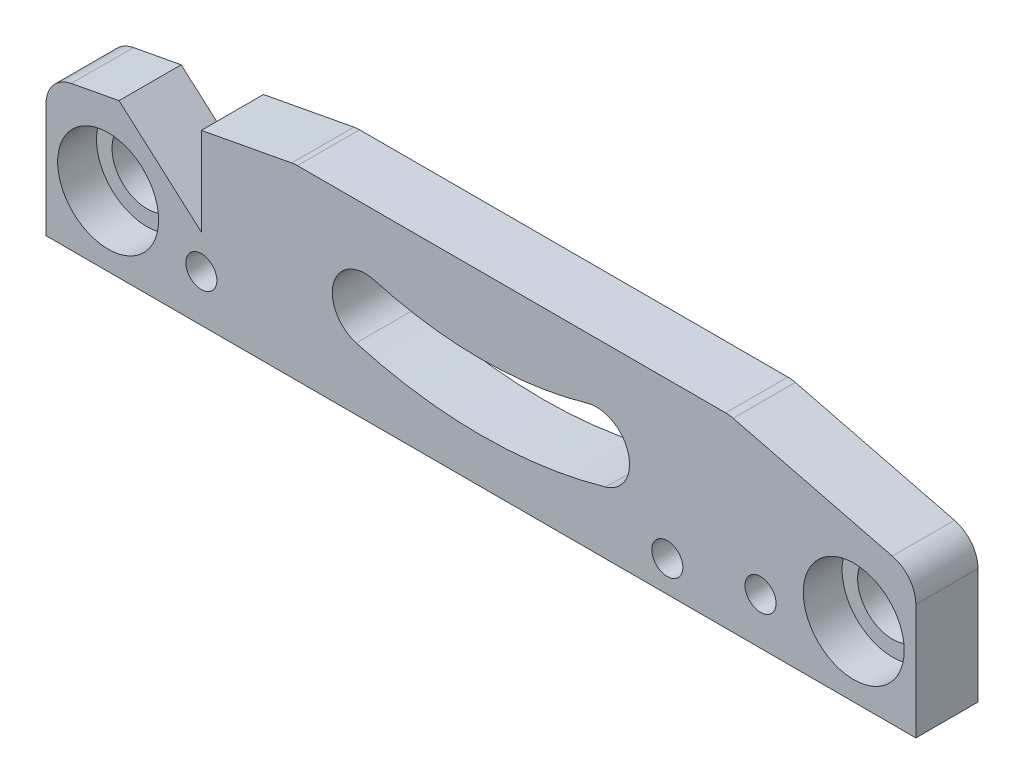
ISO-10303-21;
HEADER;
FILE_DESCRIPTION(('STEP AP214'),'2;1');
FILE_NAME('part.step','',(''),(''),'','','');
FILE_SCHEMA(('AUTOMOTIVE_DESIGN { 1 0 10303 214 1 1 1 1 }'));
ENDSEC;
DATA;
#1=APPLICATION_CONTEXT('core data for automotive mechanical design processes');
#2=APPLICATION_PROTOCOL_DEFINITION('international standard','automotive_design',2000,#1);
#3=PRODUCT_CONTEXT('',#1,'mechanical');
#4=PRODUCT('Part','Part','',(#3));
#5=PRODUCT_RELATED_PRODUCT_CATEGORY('part','',(#4));
#6=PRODUCT_DEFINITION_FORMATION('','',#4);
#7=PRODUCT_DEFINITION_CONTEXT('part definition',#1,'design');
#8=PRODUCT_DEFINITION('design','',#6,#7);
#9=PRODUCT_DEFINITION_SHAPE('','',#8);
#10=(LENGTH_UNIT() NAMED_UNIT(*) SI_UNIT(.MILLI.,.METRE.));
#11=(NAMED_UNIT(*) PLANE_ANGLE_UNIT() SI_UNIT($,.RADIAN.));
#12=(NAMED_UNIT(*) SI_UNIT($,.STERADIAN.) SOLID_ANGLE_UNIT());
#13=UNCERTAINTY_MEASURE_WITH_UNIT(LENGTH_MEASURE(1.E-05),#10,'distance_accuracy_value','');
#14=(GEOMETRIC_REPRESENTATION_CONTEXT(3) GLOBAL_UNCERTAINTY_ASSIGNED_CONTEXT((#13)) GLOBAL_UNIT_ASSIGNED_CONTEXT((#10,
#11,#12)) REPRESENTATION_CONTEXT('',''));
#15=CARTESIAN_POINT('',(0.,0.,0.));
#16=DIRECTION('',(0.,0.,1.));
#17=DIRECTION('',(1.,0.,0.));
#18=AXIS2_PLACEMENT_3D('',#15,#16,#17);
#19=CARTESIAN_POINT('',(-44.45,19.05,6.35));
#20=DIRECTION('',(0.,0.,1.));
#21=DIRECTION('',(1.,0.,0.));
#22=AXIS2_PLACEMENT_3D('',#19,#20,#21);
#23=PLANE('',#22);
#24=CARTESIAN_POINT('',(-28.575,4.7625,6.35));
#25=DIRECTION('',(0.,0.,1.));
#26=DIRECTION('',(1.,0.,0.));
#27=AXIS2_PLACEMENT_3D('',#24,#25,#26);
#28=CIRCLE('',#27,1.5875);
#29=CARTESIAN_POINT('',(-26.9875,4.7625,6.35));
#30=VERTEX_POINT('',#29);
#31=EDGE_CURVE('E549',#30,#30,#28,.T.);
#32=ORIENTED_EDGE('',*,*,#31,.F.);
#33=EDGE_LOOP('',(#32));
#34=FACE_BOUND('',#33,.T.);
#35=CARTESIAN_POINT('',(19.05,3.17500000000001,6.34999999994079));
#36=DIRECTION('',(0.,0.,1.));
#37=DIRECTION('',(1.,0.,0.));
#38=AXIS2_PLACEMENT_3D('',#35,#36,#37);
#39=CIRCLE('',#38,1.5875);
#40=CARTESIAN_POINT('',(20.6375,3.17500000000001,6.34999999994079));
#41=VERTEX_POINT('',#40);
#42=EDGE_CURVE('E550',#41,#41,#39,.T.);
#43=ORIENTED_EDGE('',*,*,#42,.F.);
#44=EDGE_LOOP('',(#43));
#45=FACE_BOUND('',#44,.T.);
#46=CARTESIAN_POINT('',(28.575,4.7625,6.35));
#47=DIRECTION('',(0.,0.,1.));
#48=DIRECTION('',(1.,0.,0.));
#49=AXIS2_PLACEMENT_3D('',#46,#47,#48);
#50=CIRCLE('',#49,1.5875);
#51=CARTESIAN_POINT('',(30.1625,4.7625,6.35));
#52=VERTEX_POINT('',#51);
#53=EDGE_CURVE('E558',#52,#52,#50,.T.);
#54=ORIENTED_EDGE('',*,*,#53,.F.);
#55=EDGE_LOOP('',(#54));
#56=FACE_BOUND('',#55,.T.);
#57=CARTESIAN_POINT('',(-38.1,7.14375,6.35));
#58=DIRECTION('',(0.,0.,1.));
#59=DIRECTION('',(1.,0.,0.));
#60=AXIS2_PLACEMENT_3D('',#57,#58,#59);
#61=CIRCLE('',#60,5.15937499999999);
#62=CARTESIAN_POINT('',(-32.940625,7.14375,6.35));
#63=VERTEX_POINT('',#62);
#64=EDGE_CURVE('E574',#63,#63,#61,.T.);
#65=ORIENTED_EDGE('',*,*,#64,.F.);
#66=EDGE_LOOP('',(#65));
#67=FACE_BOUND('',#66,.T.);
#68=CARTESIAN_POINT('',(0.,50.8,6.35));
#69=DIRECTION('',(0.,0.,-1.));
#70=DIRECTION('',(-1.,0.,0.));
#71=AXIS2_PLACEMENT_3D('',#68,#69,#70);
#72=CIRCLE('',#71,46.2359375);
#73=CARTESIAN_POINT('',(12.7443515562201,6.35516430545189,6.35));
#74=VERTEX_POINT('',#73);
#75=CARTESIAN_POINT('',(-12.74435155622,6.35516430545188,6.35));
#76=VERTEX_POINT('',#75);
#77=EDGE_CURVE('E163',#74,#76,#72,.T.);
#78=ORIENTED_EDGE('',*,*,#77,.T.);
#79=CARTESIAN_POINT('',(-11.8145061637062,9.59792055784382,6.35));
#80=DIRECTION('',(0.,0.,-1.));
#81=DIRECTION('',(-1.,0.,0.));
#82=AXIS2_PLACEMENT_3D('',#79,#80,#81);
#83=CIRCLE('',#82,3.3734375);
#84=CARTESIAN_POINT('',(-10.8846607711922,12.8406768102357,6.35));
#85=VERTEX_POINT('',#84);
#86=EDGE_CURVE('E183',#76,#85,#83,.T.);
#87=ORIENTED_EDGE('',*,*,#86,.T.);
#88=CARTESIAN_POINT('',(0.,50.8,6.35));
#89=DIRECTION('',(0.,0.,1.));
#90=DIRECTION('',(1.,0.,0.));
#91=AXIS2_PLACEMENT_3D('',#88,#89,#90);
#92=CIRCLE('',#91,39.4890625);
#93=CARTESIAN_POINT('',(10.8846607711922,12.8406768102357,6.35));
#94=VERTEX_POINT('',#93);
#95=EDGE_CURVE('E169',#85,#94,#92,.T.);
#96=ORIENTED_EDGE('',*,*,#95,.T.);
#97=CARTESIAN_POINT('',(11.8145061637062,9.59792055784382,6.35));
#98=DIRECTION('',(0.,0.,-1.));
#99=DIRECTION('',(-1.,0.,0.));
#100=AXIS2_PLACEMENT_3D('',#97,#98,#99);
#101=CIRCLE('',#100,3.3734375);
#102=EDGE_CURVE('E187',#94,#74,#101,.T.);
#103=ORIENTED_EDGE('',*,*,#102,.T.);
#104=EDGE_LOOP('',(#78,#87,#96,#103));
#105=FACE_BOUND('',#104,.T.);
#106=DIRECTION('',(0.,1.,0.));
#107=VECTOR('',#106,1.);
#108=CARTESIAN_POINT('',(44.45,0.,6.35));
#109=LINE('',#108,#107);
#110=CARTESIAN_POINT('',(44.45,0.,6.35));
#111=VERTEX_POINT('',#110);
#112=CARTESIAN_POINT('',(44.45,11.808534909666,6.35));
#113=VERTEX_POINT('',#112);
#114=EDGE_CURVE('E230',#111,#113,#109,.T.);
#115=ORIENTED_EDGE('',*,*,#114,.T.);
#116=CARTESIAN_POINT('',(41.275,11.808534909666,6.35));
#117=DIRECTION('',(0.,0.,1.));
#118=DIRECTION('',(1.,0.,0.));
#119=AXIS2_PLACEMENT_3D('',#116,#117,#118);
#120=CIRCLE('',#119,3.175);
#121=CARTESIAN_POINT('',(42.0450506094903,14.8887373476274,6.35));
#122=VERTEX_POINT('',#121);
#123=EDGE_CURVE('E262',#113,#122,#120,.T.);
#124=ORIENTED_EDGE('',*,*,#123,.T.);
#125=DIRECTION('',(-0.970142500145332,0.242535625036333,0.));
#126=VECTOR('',#125,1.);
#127=CARTESIAN_POINT('',(44.45,14.2875,6.35));
#128=LINE('',#127,#126);
#129=CARTESIAN_POINT('',(25.7791902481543,18.9552024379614,6.35));
#130=VERTEX_POINT('',#129);
#131=EDGE_CURVE('E220',#122,#130,#128,.T.);
#132=ORIENTED_EDGE('',*,*,#131,.T.);
#133=CARTESIAN_POINT('',(25.0091396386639,15.875,6.35));
#134=DIRECTION('',(0.,0.,1.));
#135=DIRECTION('',(1.,0.,0.));
#136=AXIS2_PLACEMENT_3D('',#133,#134,#135);
#137=CIRCLE('',#136,3.175);
#138=CARTESIAN_POINT('',(25.0091396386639,19.05,6.35));
#139=VERTEX_POINT('',#138);
#140=EDGE_CURVE('E256',#130,#139,#137,.T.);
#141=ORIENTED_EDGE('',*,*,#140,.T.);
#142=DIRECTION('',(1.,0.,0.));
#143=VECTOR('',#142,1.);
#144=CARTESIAN_POINT('',(-44.45,19.05,6.35));
#145=LINE('',#144,#143);
#146=CARTESIAN_POINT('',(-18.7549148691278,19.05,6.35));
#147=VERTEX_POINT('',#146);
#148=EDGE_CURVE('E227',#147,#139,#145,.T.);
#149=ORIENTED_EDGE('',*,*,#148,.F.);
#150=CARTESIAN_POINT('',(-18.7549148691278,15.875,6.35));
#151=DIRECTION('',(0.,0.,1.));
#152=DIRECTION('',(1.,0.,0.));
#153=AXIS2_PLACEMENT_3D('',#150,#151,#152);
#154=CIRCLE('',#153,3.175);
#155=CARTESIAN_POINT('',(-19.3400309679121,18.9956191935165,6.35));
#156=VERTEX_POINT('',#155);
#157=EDGE_CURVE('E258',#147,#156,#154,.T.);
#158=ORIENTED_EDGE('',*,*,#157,.T.);
#159=DIRECTION('',(0.982872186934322,0.184288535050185,0.));
#160=VECTOR('',#159,1.);
#161=CARTESIAN_POINT('',(-44.45,14.2875,6.35));
#162=LINE('',#161,#160);
#163=CARTESIAN_POINT('',(-28.575,17.2640625,6.35));
#164=VERTEX_POINT('',#163);
#165=EDGE_CURVE('E214',#164,#156,#162,.T.);
#166=ORIENTED_EDGE('',*,*,#165,.F.);
#167=DIRECTION('',(0.,1.,0.));
#168=VECTOR('',#167,1.);
#169=CARTESIAN_POINT('',(-28.575,8.26226105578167,6.35));
#170=LINE('',#169,#168);
#171=CARTESIAN_POINT('',(-28.575,8.26226105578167,6.35));
#172=VERTEX_POINT('',#171);
#173=EDGE_CURVE('E170',#172,#164,#170,.T.);
#174=ORIENTED_EDGE('',*,*,#173,.F.);
#175=DIRECTION('',(0.749616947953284,-0.661871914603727,0.));
#176=VECTOR('',#175,1.);
#177=CARTESIAN_POINT('',(-36.9843867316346,15.6873024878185,6.35));
#178=LINE('',#177,#176);
#179=CARTESIAN_POINT('',(-36.9843867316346,15.6873024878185,6.35));
#180=VERTEX_POINT('',#179);
#181=EDGE_CURVE('E200',#180,#172,#178,.T.);
#182=ORIENTED_EDGE('',*,*,#181,.F.);
#183=CARTESIAN_POINT('',(-41.8601160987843,14.7731032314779,6.35));
#184=VERTEX_POINT('',#183);
#185=EDGE_CURVE('E215',#184,#180,#162,.T.);
#186=ORIENTED_EDGE('',*,*,#185,.F.);
#187=CARTESIAN_POINT('',(-41.275,11.6524840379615,6.35));
#188=DIRECTION('',(0.,0.,1.));
#189=DIRECTION('',(1.,0.,0.));
#190=AXIS2_PLACEMENT_3D('',#187,#188,#189);
#191=CIRCLE('',#190,3.175);
#192=CARTESIAN_POINT('',(-44.45,11.6524840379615,6.35));
#193=VERTEX_POINT('',#192);
#194=EDGE_CURVE('E260',#184,#193,#191,.T.);
#195=ORIENTED_EDGE('',*,*,#194,.T.);
#196=DIRECTION('',(0.,1.,0.));
#197=VECTOR('',#196,1.);
#198=CARTESIAN_POINT('',(-44.45,0.,6.35));
#199=LINE('',#198,#197);
#200=CARTESIAN_POINT('',(-44.45,0.,6.35));
#201=VERTEX_POINT('',#200);
#202=EDGE_CURVE('E237',#201,#193,#199,.T.);
#203=ORIENTED_EDGE('',*,*,#202,.F.);
#204=DIRECTION('',(-1.,0.,0.));
#205=VECTOR('',#204,1.);
#206=CARTESIAN_POINT('',(44.45,0.,6.35));
#207=LINE('',#206,#205);
#208=EDGE_CURVE('E234',#111,#201,#207,.T.);
#209=ORIENTED_EDGE('',*,*,#208,.F.);
#210=EDGE_LOOP('',(#115,#124,#132,#141,#149,#158,#166,#174,#182,#186,#195,#203,#209));
#211=FACE_BOUND('',#210,.T.);
#212=CARTESIAN_POINT('',(38.1,7.14375,6.35));
#213=DIRECTION('',(0.,0.,1.));
#214=DIRECTION('',(1.,0.,0.));
#215=AXIS2_PLACEMENT_3D('',#212,#213,#214);
#216=CIRCLE('',#215,5.15937499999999);
#217=CARTESIAN_POINT('',(43.259375,7.14375,6.35));
#218=VERTEX_POINT('',#217);
#219=EDGE_CURVE('E185',#218,#218,#216,.T.);
#220=ORIENTED_EDGE('',*,*,#219,.F.);
#221=EDGE_LOOP('',(#220));
#222=FACE_BOUND('',#221,.T.);
#223=ADVANCED_FACE('F32',(#34,#45,#56,#67,#105,#211,#222),#23,.T.);
#224=CARTESIAN_POINT('',(-44.45,19.05,0.));
#225=DIRECTION('',(0.,0.,1.));
#226=DIRECTION('',(1.,0.,0.));
#227=AXIS2_PLACEMENT_3D('',#224,#225,#226);
#228=PLANE('',#227);
#229=CARTESIAN_POINT('',(-28.575,4.7625,0.));
#230=DIRECTION('',(0.,0.,1.));
#231=DIRECTION('',(1.,0.,0.));
#232=AXIS2_PLACEMENT_3D('',#229,#230,#231);
#233=CIRCLE('',#232,1.5875);
#234=CARTESIAN_POINT('',(-26.9875,4.7625,0.));
#235=VERTEX_POINT('',#234);
#236=EDGE_CURVE('E547',#235,#235,#233,.T.);
#237=ORIENTED_EDGE('',*,*,#236,.T.);
#238=EDGE_LOOP('',(#237));
#239=FACE_BOUND('',#238,.T.);
#240=CARTESIAN_POINT('',(19.05,3.17500000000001,0.));
#241=DIRECTION('',(0.,0.,1.));
#242=DIRECTION('',(1.,0.,0.));
#243=AXIS2_PLACEMENT_3D('',#240,#241,#242);
#244=CIRCLE('',#243,1.5875);
#245=CARTESIAN_POINT('',(20.6375,3.17500000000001,0.));
#246=VERTEX_POINT('',#245);
#247=EDGE_CURVE('E553',#246,#246,#244,.T.);
#248=ORIENTED_EDGE('',*,*,#247,.T.);
#249=EDGE_LOOP('',(#248));
#250=FACE_BOUND('',#249,.T.);
#251=CARTESIAN_POINT('',(28.575,4.7625,0.));
#252=DIRECTION('',(0.,0.,1.));
#253=DIRECTION('',(1.,0.,0.));
#254=AXIS2_PLACEMENT_3D('',#251,#252,#253);
#255=CIRCLE('',#254,1.5875);
#256=CARTESIAN_POINT('',(30.1625,4.7625,0.));
#257=VERTEX_POINT('',#256);
#258=EDGE_CURVE('E560',#257,#257,#255,.T.);
#259=ORIENTED_EDGE('',*,*,#258,.T.);
#260=EDGE_LOOP('',(#259));
#261=FACE_BOUND('',#260,.T.);
#262=CARTESIAN_POINT('',(-38.1,7.14375,0.));
#263=DIRECTION('',(0.,0.,1.));
#264=DIRECTION('',(1.,0.,0.));
#265=AXIS2_PLACEMENT_3D('',#262,#263,#264);
#266=CIRCLE('',#265,3.57187500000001);
#267=CARTESIAN_POINT('',(-34.528125,7.14375,0.));
#268=VERTEX_POINT('',#267);
#269=EDGE_CURVE('E563',#268,#268,#266,.T.);
#270=ORIENTED_EDGE('',*,*,#269,.T.);
#271=EDGE_LOOP('',(#270));
#272=FACE_BOUND('',#271,.T.);
#273=CARTESIAN_POINT('',(-11.8145061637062,9.59792055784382,0.));
#274=DIRECTION('',(0.,0.,-1.));
#275=DIRECTION('',(-1.,0.,0.));
#276=AXIS2_PLACEMENT_3D('',#273,#274,#275);
#277=CIRCLE('',#276,3.3734375);
#278=CARTESIAN_POINT('',(-12.74435155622,6.35516430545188,0.));
#279=VERTEX_POINT('',#278);
#280=CARTESIAN_POINT('',(-10.8846607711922,12.8406768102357,0.));
#281=VERTEX_POINT('',#280);
#282=EDGE_CURVE('E152',#279,#281,#277,.T.);
#283=ORIENTED_EDGE('',*,*,#282,.F.);
#284=CARTESIAN_POINT('',(0.,50.8,0.));
#285=DIRECTION('',(0.,0.,-1.));
#286=DIRECTION('',(-1.,0.,0.));
#287=AXIS2_PLACEMENT_3D('',#284,#285,#286);
#288=CIRCLE('',#287,46.2359375);
#289=CARTESIAN_POINT('',(12.7443515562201,6.35516430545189,0.));
#290=VERTEX_POINT('',#289);
#291=EDGE_CURVE('E178',#290,#279,#288,.T.);
#292=ORIENTED_EDGE('',*,*,#291,.F.);
#293=CARTESIAN_POINT('',(11.8145061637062,9.59792055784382,0.));
#294=DIRECTION('',(0.,0.,-1.));
#295=DIRECTION('',(-1.,0.,0.));
#296=AXIS2_PLACEMENT_3D('',#293,#294,#295);
#297=CIRCLE('',#296,3.3734375);
#298=CARTESIAN_POINT('',(10.8846607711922,12.8406768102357,0.));
#299=VERTEX_POINT('',#298);
#300=EDGE_CURVE('E176',#299,#290,#297,.T.);
#301=ORIENTED_EDGE('',*,*,#300,.F.);
#302=CARTESIAN_POINT('',(0.,50.8,0.));
#303=DIRECTION('',(0.,0.,1.));
#304=DIRECTION('',(1.,0.,0.));
#305=AXIS2_PLACEMENT_3D('',#302,#303,#304);
#306=CIRCLE('',#305,39.4890625);
#307=EDGE_CURVE('E162',#281,#299,#306,.T.);
#308=ORIENTED_EDGE('',*,*,#307,.F.);
#309=EDGE_LOOP('',(#283,#292,#301,#308));
#310=FACE_BOUND('',#309,.T.);
#311=DIRECTION('',(-0.970142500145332,0.242535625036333,0.));
#312=VECTOR('',#311,1.);
#313=CARTESIAN_POINT('',(44.45,14.2875,0.));
#314=LINE('',#313,#312);
#315=CARTESIAN_POINT('',(42.0450506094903,14.8887373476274,0.));
#316=VERTEX_POINT('',#315);
#317=CARTESIAN_POINT('',(25.7791902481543,18.9552024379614,0.));
#318=VERTEX_POINT('',#317);
#319=EDGE_CURVE('E221',#316,#318,#314,.T.);
#320=ORIENTED_EDGE('',*,*,#319,.F.);
#321=CARTESIAN_POINT('',(41.275,11.808534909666,0.));
#322=DIRECTION('',(0.,0.,1.));
#323=DIRECTION('',(1.,0.,0.));
#324=AXIS2_PLACEMENT_3D('',#321,#322,#323);
#325=CIRCLE('',#324,3.175);
#326=CARTESIAN_POINT('',(44.45,11.808534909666,0.));
#327=VERTEX_POINT('',#326);
#328=EDGE_CURVE('E274',#316,#327,#325,.F.);
#329=ORIENTED_EDGE('',*,*,#328,.T.);
#330=DIRECTION('',(0.,1.,0.));
#331=VECTOR('',#330,1.);
#332=CARTESIAN_POINT('',(44.45,0.,0.));
#333=LINE('',#332,#331);
#334=CARTESIAN_POINT('',(44.45,0.,0.));
#335=VERTEX_POINT('',#334);
#336=EDGE_CURVE('E243',#335,#327,#333,.T.);
#337=ORIENTED_EDGE('',*,*,#336,.F.);
#338=DIRECTION('',(-1.,0.,0.));
#339=VECTOR('',#338,1.);
#340=CARTESIAN_POINT('',(44.45,0.,0.));
#341=LINE('',#340,#339);
#342=CARTESIAN_POINT('',(-44.45,0.,0.));
#343=VERTEX_POINT('',#342);
#344=EDGE_CURVE('E246',#335,#343,#341,.T.);
#345=ORIENTED_EDGE('',*,*,#344,.T.);
#346=DIRECTION('',(0.,1.,0.));
#347=VECTOR('',#346,1.);
#348=CARTESIAN_POINT('',(-44.45,0.,0.));
#349=LINE('',#348,#347);
#350=CARTESIAN_POINT('',(-44.45,11.6524840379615,0.));
#351=VERTEX_POINT('',#350);
#352=EDGE_CURVE('E231',#343,#351,#349,.T.);
#353=ORIENTED_EDGE('',*,*,#352,.T.);
#354=CARTESIAN_POINT('',(-41.275,11.6524840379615,0.));
#355=DIRECTION('',(0.,0.,1.));
#356=DIRECTION('',(1.,0.,0.));
#357=AXIS2_PLACEMENT_3D('',#354,#355,#356);
#358=CIRCLE('',#357,3.175);
#359=CARTESIAN_POINT('',(-41.8601160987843,14.7731032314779,0.));
#360=VERTEX_POINT('',#359);
#361=EDGE_CURVE('E47',#351,#360,#358,.F.);
#362=ORIENTED_EDGE('',*,*,#361,.T.);
#363=DIRECTION('',(-0.982872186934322,-0.184288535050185,0.));
#364=VECTOR('',#363,1.);
#365=CARTESIAN_POINT('',(-43.587358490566,14.4492452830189,0.));
#366=LINE('',#365,#364);
#367=CARTESIAN_POINT('',(-36.9843867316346,15.6873024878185,0.));
#368=VERTEX_POINT('',#367);
#369=EDGE_CURVE('E217',#368,#360,#366,.T.);
#370=ORIENTED_EDGE('',*,*,#369,.F.);
#371=DIRECTION('',(0.749616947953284,-0.661871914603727,0.));
#372=VECTOR('',#371,1.);
#373=CARTESIAN_POINT('',(-36.9843867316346,15.6873024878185,0.));
#374=LINE('',#373,#372);
#375=CARTESIAN_POINT('',(-28.575,8.26226105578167,0.));
#376=VERTEX_POINT('',#375);
#377=EDGE_CURVE('E199',#368,#376,#374,.T.);
#378=ORIENTED_EDGE('',*,*,#377,.T.);
#379=DIRECTION('',(0.,1.,0.));
#380=VECTOR('',#379,1.);
#381=CARTESIAN_POINT('',(-28.575,8.26226105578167,0.));
#382=LINE('',#381,#380);
#383=CARTESIAN_POINT('',(-28.575,17.2640625,0.));
#384=VERTEX_POINT('',#383);
#385=EDGE_CURVE('E196',#376,#384,#382,.T.);
#386=ORIENTED_EDGE('',*,*,#385,.T.);
#387=CARTESIAN_POINT('',(-19.3400309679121,18.9956191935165,0.));
#388=VERTEX_POINT('',#387);
#389=EDGE_CURVE('E218',#388,#384,#366,.T.);
#390=ORIENTED_EDGE('',*,*,#389,.F.);
#391=CARTESIAN_POINT('',(-18.7549148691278,15.875,0.));
#392=DIRECTION('',(0.,0.,1.));
#393=DIRECTION('',(1.,0.,0.));
#394=AXIS2_PLACEMENT_3D('',#391,#392,#393);
#395=CIRCLE('',#394,3.175);
#396=CARTESIAN_POINT('',(-18.7549148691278,19.05,0.));
#397=VERTEX_POINT('',#396);
#398=EDGE_CURVE('E271',#388,#397,#395,.F.);
#399=ORIENTED_EDGE('',*,*,#398,.T.);
#400=DIRECTION('',(1.,0.,0.));
#401=VECTOR('',#400,1.);
#402=CARTESIAN_POINT('',(-44.45,19.05,0.));
#403=LINE('',#402,#401);
#404=CARTESIAN_POINT('',(25.0091396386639,19.05,0.));
#405=VERTEX_POINT('',#404);
#406=EDGE_CURVE('E224',#397,#405,#403,.T.);
#407=ORIENTED_EDGE('',*,*,#406,.T.);
#408=CARTESIAN_POINT('',(25.0091396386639,15.875,0.));
#409=DIRECTION('',(0.,0.,1.));
#410=DIRECTION('',(1.,0.,0.));
#411=AXIS2_PLACEMENT_3D('',#408,#409,#410);
#412=CIRCLE('',#411,3.175);
#413=EDGE_CURVE('E269',#405,#318,#412,.F.);
#414=ORIENTED_EDGE('',*,*,#413,.T.);
#415=EDGE_LOOP('',(#320,#329,#337,#345,#353,#362,#370,#378,#386,#390,#399,#407,#414));
#416=FACE_BOUND('',#415,.T.);
#417=CARTESIAN_POINT('',(38.1,7.14375,0.));
#418=DIRECTION('',(0.,0.,1.));
#419=DIRECTION('',(1.,0.,0.));
#420=AXIS2_PLACEMENT_3D('',#417,#418,#419);
#421=CIRCLE('',#420,3.57187500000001);
#422=CARTESIAN_POINT('',(41.671875,7.14375,0.));
#423=VERTEX_POINT('',#422);
#424=EDGE_CURVE('E577',#423,#423,#421,.T.);
#425=ORIENTED_EDGE('',*,*,#424,.T.);
#426=EDGE_LOOP('',(#425));
#427=FACE_BOUND('',#426,.T.);
#428=ADVANCED_FACE('F174',(#239,#250,#261,#272,#310,#416,#427),#228,.F.);
#429=CARTESIAN_POINT('',(-44.45,14.2875,6.35));
#430=DIRECTION('',(-0.184288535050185,0.982872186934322,0.));
#431=DIRECTION('',(-0.982872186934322,-0.184288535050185,0.));
#432=AXIS2_PLACEMENT_3D('',#429,#430,#431);
#433=PLANE('',#432);
#434=ORIENTED_EDGE('',*,*,#165,.T.);
#435=DIRECTION('',(0.,0.,-1.));
#436=VECTOR('',#435,1.);
#437=CARTESIAN_POINT('',(-19.3400309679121,18.9956191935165,6.35));
#438=LINE('',#437,#436);
#439=EDGE_CURVE('E280',#156,#388,#438,.T.);
#440=ORIENTED_EDGE('',*,*,#439,.T.);
#441=ORIENTED_EDGE('',*,*,#389,.T.);
#442=DIRECTION('',(0.,0.,1.));
#443=VECTOR('',#442,1.);
#444=CARTESIAN_POINT('',(-28.575,17.2640625,0.));
#445=LINE('',#444,#443);
#446=EDGE_CURVE('E211',#384,#164,#445,.T.);
#447=ORIENTED_EDGE('',*,*,#446,.T.);
#448=EDGE_LOOP('',(#434,#440,#441,#447));
#449=FACE_BOUND('',#448,.T.);
#450=ADVANCED_FACE('F333',(#449),#433,.T.);
#451=CARTESIAN_POINT('',(-44.45,19.05,6.35));
#452=DIRECTION('',(0.,1.,0.));
#453=DIRECTION('',(-1.,0.,0.));
#454=AXIS2_PLACEMENT_3D('',#451,#452,#453);
#455=PLANE('',#454);
#456=ORIENTED_EDGE('',*,*,#406,.F.);
#457=DIRECTION('',(0.,0.,-1.));
#458=VECTOR('',#457,1.);
#459=CARTESIAN_POINT('',(-18.7549148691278,19.05,6.35));
#460=LINE('',#459,#458);
#461=EDGE_CURVE('E11',#397,#147,#460,.F.);
#462=ORIENTED_EDGE('',*,*,#461,.T.);
#463=ORIENTED_EDGE('',*,*,#148,.T.);
#464=DIRECTION('',(0.,0.,1.));
#465=VECTOR('',#464,1.);
#466=CARTESIAN_POINT('',(25.0091396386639,19.05,6.35));
#467=LINE('',#466,#465);
#468=EDGE_CURVE('E40',#139,#405,#467,.F.);
#469=ORIENTED_EDGE('',*,*,#468,.T.);
#470=EDGE_LOOP('',(#456,#462,#463,#469));
#471=FACE_BOUND('',#470,.T.);
#472=ADVANCED_FACE('F285',(#471),#455,.T.);
#473=CARTESIAN_POINT('',(-44.45,0.,6.35));
#474=DIRECTION('',(-1.,0.,0.));
#475=DIRECTION('',(0.,-1.,0.));
#476=AXIS2_PLACEMENT_3D('',#473,#474,#475);
#477=PLANE('',#476);
#478=ORIENTED_EDGE('',*,*,#202,.T.);
#479=DIRECTION('',(0.,0.,-1.));
#480=VECTOR('',#479,1.);
#481=CARTESIAN_POINT('',(-44.45,11.6524840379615,6.35));
#482=LINE('',#481,#480);
#483=EDGE_CURVE('E276',#193,#351,#482,.T.);
#484=ORIENTED_EDGE('',*,*,#483,.T.);
#485=ORIENTED_EDGE('',*,*,#352,.F.);
#486=DIRECTION('',(0.,0.,-1.));
#487=VECTOR('',#486,1.);
#488=CARTESIAN_POINT('',(-44.45,0.,6.35));
#489=LINE('',#488,#487);
#490=EDGE_CURVE('E250',#201,#343,#489,.T.);
#491=ORIENTED_EDGE('',*,*,#490,.F.);
#492=EDGE_LOOP('',(#478,#484,#485,#491));
#493=FACE_BOUND('',#492,.T.);
#494=ADVANCED_FACE('F315',(#493),#477,.T.);
#495=CARTESIAN_POINT('',(44.45,0.,6.35));
#496=DIRECTION('',(-1.,0.,0.));
#497=DIRECTION('',(0.,-1.,0.));
#498=AXIS2_PLACEMENT_3D('',#495,#496,#497);
#499=PLANE('',#498);
#500=ORIENTED_EDGE('',*,*,#336,.T.);
#501=DIRECTION('',(0.,0.,1.));
#502=VECTOR('',#501,1.);
#503=CARTESIAN_POINT('',(44.45,11.808534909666,6.35));
#504=LINE('',#503,#502);
#505=EDGE_CURVE('E252',#327,#113,#504,.T.);
#506=ORIENTED_EDGE('',*,*,#505,.T.);
#507=ORIENTED_EDGE('',*,*,#114,.F.);
#508=DIRECTION('',(0.,0.,-1.));
#509=VECTOR('',#508,1.);
#510=CARTESIAN_POINT('',(44.45,0.,6.35));
#511=LINE('',#510,#509);
#512=EDGE_CURVE('E240',#111,#335,#511,.T.);
#513=ORIENTED_EDGE('',*,*,#512,.T.);
#514=EDGE_LOOP('',(#500,#506,#507,#513));
#515=FACE_BOUND('',#514,.T.);
#516=ADVANCED_FACE('F307',(#515),#499,.F.);
#517=CARTESIAN_POINT('',(44.45,0.,6.35));
#518=DIRECTION('',(0.,-1.,0.));
#519=DIRECTION('',(1.,0.,0.));
#520=AXIS2_PLACEMENT_3D('',#517,#518,#519);
#521=PLANE('',#520);
#522=ORIENTED_EDGE('',*,*,#344,.F.);
#523=ORIENTED_EDGE('',*,*,#512,.F.);
#524=ORIENTED_EDGE('',*,*,#208,.T.);
#525=ORIENTED_EDGE('',*,*,#490,.T.);
#526=EDGE_LOOP('',(#522,#523,#524,#525));
#527=FACE_BOUND('',#526,.T.);
#528=ADVANCED_FACE('F312',(#527),#521,.T.);
#529=CARTESIAN_POINT('',(44.45,14.2875,0.));
#530=DIRECTION('',(0.242535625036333,0.970142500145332,0.));
#531=DIRECTION('',(-0.970142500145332,0.242535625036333,0.));
#532=AXIS2_PLACEMENT_3D('',#529,#530,#531);
#533=PLANE('',#532);
#534=ORIENTED_EDGE('',*,*,#131,.F.);
#535=DIRECTION('',(0.,0.,1.));
#536=VECTOR('',#535,1.);
#537=CARTESIAN_POINT('',(42.0450506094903,14.8887373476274,0.));
#538=LINE('',#537,#536);
#539=EDGE_CURVE('E267',#122,#316,#538,.F.);
#540=ORIENTED_EDGE('',*,*,#539,.T.);
#541=ORIENTED_EDGE('',*,*,#319,.T.);
#542=DIRECTION('',(0.,0.,1.));
#543=VECTOR('',#542,1.);
#544=CARTESIAN_POINT('',(25.7791902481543,18.9552024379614,0.));
#545=LINE('',#544,#543);
#546=EDGE_CURVE('E264',#318,#130,#545,.T.);
#547=ORIENTED_EDGE('',*,*,#546,.T.);
#548=EDGE_LOOP('',(#534,#540,#541,#547));
#549=FACE_BOUND('',#548,.T.);
#550=ADVANCED_FACE('F296',(#549),#533,.T.);
#551=ORIENTED_EDGE('',*,*,#369,.T.);
#552=DIRECTION('',(0.,0.,-1.));
#553=VECTOR('',#552,1.);
#554=CARTESIAN_POINT('',(-41.8601160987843,14.7731032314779,6.35));
#555=LINE('',#554,#553);
#556=EDGE_CURVE('E278',#360,#184,#555,.F.);
#557=ORIENTED_EDGE('',*,*,#556,.T.);
#558=ORIENTED_EDGE('',*,*,#185,.T.);
#559=DIRECTION('',(0.,0.,1.));
#560=VECTOR('',#559,1.);
#561=CARTESIAN_POINT('',(-36.9843867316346,15.6873024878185,0.));
#562=LINE('',#561,#560);
#563=EDGE_CURVE('E203',#368,#180,#562,.T.);
#564=ORIENTED_EDGE('',*,*,#563,.F.);
#565=EDGE_LOOP('',(#551,#557,#558,#564));
#566=FACE_BOUND('',#565,.T.);
#567=ADVANCED_FACE('F323',(#566),#433,.T.);
#568=CARTESIAN_POINT('',(-28.575,8.26226105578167,0.));
#569=DIRECTION('',(1.,0.,0.));
#570=DIRECTION('',(0.,0.,-1.));
#571=AXIS2_PLACEMENT_3D('',#568,#569,#570);
#572=PLANE('',#571);
#573=ORIENTED_EDGE('',*,*,#173,.T.);
#574=ORIENTED_EDGE('',*,*,#446,.F.);
#575=ORIENTED_EDGE('',*,*,#385,.F.);
#576=DIRECTION('',(0.,0.,1.));
#577=VECTOR('',#576,1.);
#578=CARTESIAN_POINT('',(-28.575,8.26226105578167,0.));
#579=LINE('',#578,#577);
#580=EDGE_CURVE('E209',#376,#172,#579,.T.);
#581=ORIENTED_EDGE('',*,*,#580,.T.);
#582=EDGE_LOOP('',(#573,#574,#575,#581));
#583=FACE_BOUND('',#582,.T.);
#584=ADVANCED_FACE('F329',(#583),#572,.F.);
#585=CARTESIAN_POINT('',(-36.9843867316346,15.6873024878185,0.));
#586=DIRECTION('',(-0.661871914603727,-0.749616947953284,0.));
#587=DIRECTION('',(0.749616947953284,-0.661871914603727,0.));
#588=AXIS2_PLACEMENT_3D('',#585,#586,#587);
#589=PLANE('',#588);
#590=ORIENTED_EDGE('',*,*,#181,.T.);
#591=ORIENTED_EDGE('',*,*,#580,.F.);
#592=ORIENTED_EDGE('',*,*,#377,.F.);
#593=ORIENTED_EDGE('',*,*,#563,.T.);
#594=EDGE_LOOP('',(#590,#591,#592,#593));
#595=FACE_BOUND('',#594,.T.);
#596=ADVANCED_FACE('F325',(#595),#589,.F.);
#597=CARTESIAN_POINT('',(-11.8145061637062,9.59792055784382,0.));
#598=DIRECTION('',(0.,0.,1.));
#599=DIRECTION('',(1.,0.,0.));
#600=AXIS2_PLACEMENT_3D('',#597,#598,#599);
#601=CYLINDRICAL_SURFACE('',#600,3.3734375);
#602=ORIENTED_EDGE('',*,*,#86,.F.);
#603=DIRECTION('',(0.,0.,1.));
#604=VECTOR('',#603,1.);
#605=CARTESIAN_POINT('',(-12.74435155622,6.35516430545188,0.));
#606=LINE('',#605,#604);
#607=EDGE_CURVE('E158',#279,#76,#606,.T.);
#608=ORIENTED_EDGE('',*,*,#607,.F.);
#609=ORIENTED_EDGE('',*,*,#282,.T.);
#610=DIRECTION('',(0.,0.,1.));
#611=VECTOR('',#610,1.);
#612=CARTESIAN_POINT('',(-10.8846607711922,12.8406768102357,0.));
#613=LINE('',#612,#611);
#614=EDGE_CURVE('E155',#281,#85,#613,.T.);
#615=ORIENTED_EDGE('',*,*,#614,.T.);
#616=EDGE_LOOP('',(#602,#608,#609,#615));
#617=FACE_BOUND('',#616,.T.);
#618=ADVANCED_FACE('F154',(#617),#601,.F.);
#619=CARTESIAN_POINT('',(0.,50.8,0.));
#620=DIRECTION('',(0.,0.,1.));
#621=DIRECTION('',(1.,0.,0.));
#622=AXIS2_PLACEMENT_3D('',#619,#620,#621);
#623=CYLINDRICAL_SURFACE('',#622,39.4890625);
#624=ORIENTED_EDGE('',*,*,#95,.F.);
#625=ORIENTED_EDGE('',*,*,#614,.F.);
#626=ORIENTED_EDGE('',*,*,#307,.T.);
#627=DIRECTION('',(0.,0.,1.));
#628=VECTOR('',#627,1.);
#629=CARTESIAN_POINT('',(10.8846607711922,12.8406768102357,0.));
#630=LINE('',#629,#628);
#631=EDGE_CURVE('E171',#299,#94,#630,.T.);
#632=ORIENTED_EDGE('',*,*,#631,.T.);
#633=EDGE_LOOP('',(#624,#625,#626,#632));
#634=FACE_BOUND('',#633,.T.);
#635=ADVANCED_FACE('F166',(#634),#623,.T.);
#636=CARTESIAN_POINT('',(11.8145061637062,9.59792055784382,0.));
#637=DIRECTION('',(0.,0.,1.));
#638=DIRECTION('',(1.,0.,0.));
#639=AXIS2_PLACEMENT_3D('',#636,#637,#638);
#640=CYLINDRICAL_SURFACE('',#639,3.3734375);
#641=ORIENTED_EDGE('',*,*,#102,.F.);
#642=ORIENTED_EDGE('',*,*,#631,.F.);
#643=ORIENTED_EDGE('',*,*,#300,.T.);
#644=DIRECTION('',(0.,0.,1.));
#645=VECTOR('',#644,1.);
#646=CARTESIAN_POINT('',(12.7443515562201,6.35516430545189,0.));
#647=LINE('',#646,#645);
#648=EDGE_CURVE('E193',#290,#74,#647,.T.);
#649=ORIENTED_EDGE('',*,*,#648,.T.);
#650=EDGE_LOOP('',(#641,#642,#643,#649));
#651=FACE_BOUND('',#650,.T.);
#652=ADVANCED_FACE('F371',(#651),#640,.F.);
#653=CARTESIAN_POINT('',(0.,50.8,0.));
#654=DIRECTION('',(0.,0.,1.));
#655=DIRECTION('',(1.,0.,0.));
#656=AXIS2_PLACEMENT_3D('',#653,#654,#655);
#657=CYLINDRICAL_SURFACE('',#656,46.2359375);
#658=ORIENTED_EDGE('',*,*,#77,.F.);
#659=ORIENTED_EDGE('',*,*,#648,.F.);
#660=ORIENTED_EDGE('',*,*,#291,.T.);
#661=ORIENTED_EDGE('',*,*,#607,.T.);
#662=EDGE_LOOP('',(#658,#659,#660,#661));
#663=FACE_BOUND('',#662,.T.);
#664=ADVANCED_FACE('F367',(#663),#657,.F.);
#665=CARTESIAN_POINT('',(41.275,11.808534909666,6.35));
#666=DIRECTION('',(0.,0.,-1.));
#667=DIRECTION('',(-1.,0.,0.));
#668=AXIS2_PLACEMENT_3D('',#665,#666,#667);
#669=CYLINDRICAL_SURFACE('',#668,3.175);
#670=ORIENTED_EDGE('',*,*,#328,.F.);
#671=ORIENTED_EDGE('',*,*,#539,.F.);
#672=ORIENTED_EDGE('',*,*,#123,.F.);
#673=ORIENTED_EDGE('',*,*,#505,.F.);
#674=EDGE_LOOP('',(#670,#671,#672,#673));
#675=FACE_BOUND('',#674,.T.);
#676=ADVANCED_FACE('F305',(#675),#669,.T.);
#677=CARTESIAN_POINT('',(-41.275,11.6524840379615,6.35));
#678=DIRECTION('',(0.,0.,-1.));
#679=DIRECTION('',(-1.,0.,0.));
#680=AXIS2_PLACEMENT_3D('',#677,#678,#679);
#681=CYLINDRICAL_SURFACE('',#680,3.175);
#682=ORIENTED_EDGE('',*,*,#194,.F.);
#683=ORIENTED_EDGE('',*,*,#556,.F.);
#684=ORIENTED_EDGE('',*,*,#361,.F.);
#685=ORIENTED_EDGE('',*,*,#483,.F.);
#686=EDGE_LOOP('',(#682,#683,#684,#685));
#687=FACE_BOUND('',#686,.T.);
#688=ADVANCED_FACE('F317',(#687),#681,.T.);
#689=CARTESIAN_POINT('',(-18.7549148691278,15.875,6.35));
#690=DIRECTION('',(0.,0.,-1.));
#691=DIRECTION('',(-1.,0.,0.));
#692=AXIS2_PLACEMENT_3D('',#689,#690,#691);
#693=CYLINDRICAL_SURFACE('',#692,3.175);
#694=ORIENTED_EDGE('',*,*,#157,.F.);
#695=ORIENTED_EDGE('',*,*,#461,.F.);
#696=ORIENTED_EDGE('',*,*,#398,.F.);
#697=ORIENTED_EDGE('',*,*,#439,.F.);
#698=EDGE_LOOP('',(#694,#695,#696,#697));
#699=FACE_BOUND('',#698,.T.);
#700=ADVANCED_FACE('F337',(#699),#693,.T.);
#701=CARTESIAN_POINT('',(25.0091396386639,15.875,0.));
#702=DIRECTION('',(0.,0.,1.));
#703=DIRECTION('',(1.,0.,0.));
#704=AXIS2_PLACEMENT_3D('',#701,#702,#703);
#705=CYLINDRICAL_SURFACE('',#704,3.175);
#706=ORIENTED_EDGE('',*,*,#413,.F.);
#707=ORIENTED_EDGE('',*,*,#468,.F.);
#708=ORIENTED_EDGE('',*,*,#140,.F.);
#709=ORIENTED_EDGE('',*,*,#546,.F.);
#710=EDGE_LOOP('',(#706,#707,#708,#709));
#711=FACE_BOUND('',#710,.T.);
#712=ADVANCED_FACE('F34',(#711),#705,.T.);
#713=CARTESIAN_POINT('',(38.1,7.14375,6.35));
#714=DIRECTION('',(0.,0.,1.));
#715=DIRECTION('',(1.,0.,0.));
#716=AXIS2_PLACEMENT_3D('',#713,#714,#715);
#717=CYLINDRICAL_SURFACE('',#716,5.15937499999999);
#718=ORIENTED_EDGE('',*,*,#219,.T.);
#719=EDGE_LOOP('',(#718));
#720=FACE_BOUND('',#719,.T.);
#721=CARTESIAN_POINT('',(38.1,7.14375,2.38125));
#722=DIRECTION('',(0.,0.,1.));
#723=DIRECTION('',(1.,0.,0.));
#724=AXIS2_PLACEMENT_3D('',#721,#722,#723);
#725=CIRCLE('',#724,5.15937499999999);
#726=CARTESIAN_POINT('',(43.259375,7.14375,2.38125));
#727=VERTEX_POINT('',#726);
#728=EDGE_CURVE('E583',#727,#727,#725,.T.);
#729=ORIENTED_EDGE('',*,*,#728,.F.);
#730=EDGE_LOOP('',(#729));
#731=FACE_BOUND('',#730,.T.);
#732=ADVANCED_FACE('F343',(#720,#731),#717,.F.);
#733=CARTESIAN_POINT('',(41.671875,7.14375,2.38125));
#734=DIRECTION('',(0.,0.,1.));
#735=DIRECTION('',(1.,0.,0.));
#736=AXIS2_PLACEMENT_3D('',#733,#734,#735);
#737=PLANE('',#736);
#738=ORIENTED_EDGE('',*,*,#728,.T.);
#739=EDGE_LOOP('',(#738));
#740=FACE_BOUND('',#739,.T.);
#741=CARTESIAN_POINT('',(38.1,7.14375,2.38125));
#742=DIRECTION('',(0.,0.,1.));
#743=DIRECTION('',(1.,0.,0.));
#744=AXIS2_PLACEMENT_3D('',#741,#742,#743);
#745=CIRCLE('',#744,3.57187499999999);
#746=CARTESIAN_POINT('',(41.671875,7.14375,2.38125));
#747=VERTEX_POINT('',#746);
#748=EDGE_CURVE('E580',#747,#747,#745,.T.);
#749=ORIENTED_EDGE('',*,*,#748,.F.);
#750=EDGE_LOOP('',(#749));
#751=FACE_BOUND('',#750,.T.);
#752=ADVANCED_FACE('F455',(#740,#751),#737,.T.);
#753=CARTESIAN_POINT('',(38.1,7.14375,6.35));
#754=DIRECTION('',(0.,0.,1.));
#755=DIRECTION('',(1.,0.,0.));
#756=AXIS2_PLACEMENT_3D('',#753,#754,#755);
#757=CYLINDRICAL_SURFACE('',#756,3.571875);
#758=ORIENTED_EDGE('',*,*,#748,.T.);
#759=EDGE_LOOP('',(#758));
#760=FACE_BOUND('',#759,.T.);
#761=ORIENTED_EDGE('',*,*,#424,.F.);
#762=EDGE_LOOP('',(#761));
#763=FACE_BOUND('',#762,.T.);
#764=ADVANCED_FACE('F465',(#760,#763),#757,.F.);
#765=CARTESIAN_POINT('',(-38.1,7.14375,6.35));
#766=DIRECTION('',(0.,0.,1.));
#767=DIRECTION('',(1.,0.,0.));
#768=AXIS2_PLACEMENT_3D('',#765,#766,#767);
#769=CYLINDRICAL_SURFACE('',#768,5.15937499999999);
#770=ORIENTED_EDGE('',*,*,#64,.T.);
#771=EDGE_LOOP('',(#770));
#772=FACE_BOUND('',#771,.T.);
#773=CARTESIAN_POINT('',(-38.1,7.14375,2.38125));
#774=DIRECTION('',(0.,0.,1.));
#775=DIRECTION('',(1.,0.,0.));
#776=AXIS2_PLACEMENT_3D('',#773,#774,#775);
#777=CIRCLE('',#776,5.15937499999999);
#778=CARTESIAN_POINT('',(-32.940625,7.14375,2.38125));
#779=VERTEX_POINT('',#778);
#780=EDGE_CURVE('E571',#779,#779,#777,.T.);
#781=ORIENTED_EDGE('',*,*,#780,.F.);
#782=EDGE_LOOP('',(#781));
#783=FACE_BOUND('',#782,.T.);
#784=ADVANCED_FACE('F474',(#772,#783),#769,.F.);
#785=CARTESIAN_POINT('',(-34.528125,7.14375,2.38125));
#786=DIRECTION('',(0.,0.,1.));
#787=DIRECTION('',(1.,0.,0.));
#788=AXIS2_PLACEMENT_3D('',#785,#786,#787);
#789=PLANE('',#788);
#790=ORIENTED_EDGE('',*,*,#780,.T.);
#791=EDGE_LOOP('',(#790));
#792=FACE_BOUND('',#791,.T.);
#793=CARTESIAN_POINT('',(-38.1,7.14375,2.38125));
#794=DIRECTION('',(0.,0.,1.));
#795=DIRECTION('',(1.,0.,0.));
#796=AXIS2_PLACEMENT_3D('',#793,#794,#795);
#797=CIRCLE('',#796,3.57187499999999);
#798=CARTESIAN_POINT('',(-34.528125,7.14375,2.38125));
#799=VERTEX_POINT('',#798);
#800=EDGE_CURVE('E568',#799,#799,#797,.T.);
#801=ORIENTED_EDGE('',*,*,#800,.F.);
#802=EDGE_LOOP('',(#801));
#803=FACE_BOUND('',#802,.T.);
#804=ADVANCED_FACE('F484',(#792,#803),#789,.T.);
#805=CARTESIAN_POINT('',(-38.1,7.14375,6.35));
#806=DIRECTION('',(0.,0.,1.));
#807=DIRECTION('',(1.,0.,0.));
#808=AXIS2_PLACEMENT_3D('',#805,#806,#807);
#809=CYLINDRICAL_SURFACE('',#808,3.571875);
#810=ORIENTED_EDGE('',*,*,#800,.T.);
#811=EDGE_LOOP('',(#810));
#812=FACE_BOUND('',#811,.T.);
#813=ORIENTED_EDGE('',*,*,#269,.F.);
#814=EDGE_LOOP('',(#813));
#815=FACE_BOUND('',#814,.T.);
#816=ADVANCED_FACE('F494',(#812,#815),#809,.F.);
#817=CARTESIAN_POINT('',(28.575,4.7625,0.));
#818=DIRECTION('',(0.,0.,1.));
#819=DIRECTION('',(1.,0.,0.));
#820=AXIS2_PLACEMENT_3D('',#817,#818,#819);
#821=CYLINDRICAL_SURFACE('',#820,1.5875);
#822=ORIENTED_EDGE('',*,*,#258,.F.);
#823=EDGE_LOOP('',(#822));
#824=FACE_BOUND('',#823,.T.);
#825=ORIENTED_EDGE('',*,*,#53,.T.);
#826=EDGE_LOOP('',(#825));
#827=FACE_BOUND('',#826,.T.);
#828=ADVANCED_FACE('F504',(#824,#827),#821,.F.);
#829=CARTESIAN_POINT('',(19.05,3.17500000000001,0.));
#830=DIRECTION('',(0.,0.,1.));
#831=DIRECTION('',(1.,0.,0.));
#832=AXIS2_PLACEMENT_3D('',#829,#830,#831);
#833=CYLINDRICAL_SURFACE('',#832,1.5875);
#834=ORIENTED_EDGE('',*,*,#247,.F.);
#835=EDGE_LOOP('',(#834));
#836=FACE_BOUND('',#835,.T.);
#837=ORIENTED_EDGE('',*,*,#42,.T.);
#838=EDGE_LOOP('',(#837));
#839=FACE_BOUND('',#838,.T.);
#840=ADVANCED_FACE('F514',(#836,#839),#833,.F.);
#841=CARTESIAN_POINT('',(-28.575,4.7625,0.));
#842=DIRECTION('',(0.,0.,1.));
#843=DIRECTION('',(1.,0.,0.));
#844=AXIS2_PLACEMENT_3D('',#841,#842,#843);
#845=CYLINDRICAL_SURFACE('',#844,1.5875);
#846=ORIENTED_EDGE('',*,*,#236,.F.);
#847=EDGE_LOOP('',(#846));
#848=FACE_BOUND('',#847,.T.);
#849=ORIENTED_EDGE('',*,*,#31,.T.);
#850=EDGE_LOOP('',(#849));
#851=FACE_BOUND('',#850,.T.);
#852=ADVANCED_FACE('F523',(#848,#851),#845,.F.);
#853=CLOSED_SHELL('',(#223,#428,#450,#472,#494,#516,#528,#550,#567,#584,#596,#618,#635,#652,
#664,#676,#688,#700,#712,#732,#752,#764,#784,#804,#816,#828,#840,#852));
#854=MANIFOLD_SOLID_BREP('B2',#853);
#855=ADVANCED_BREP_SHAPE_REPRESENTATION('',(#18,#854),#14);
#856=SHAPE_DEFINITION_REPRESENTATION(#9,#855);
ENDSEC;
END-ISO-10303-21;
